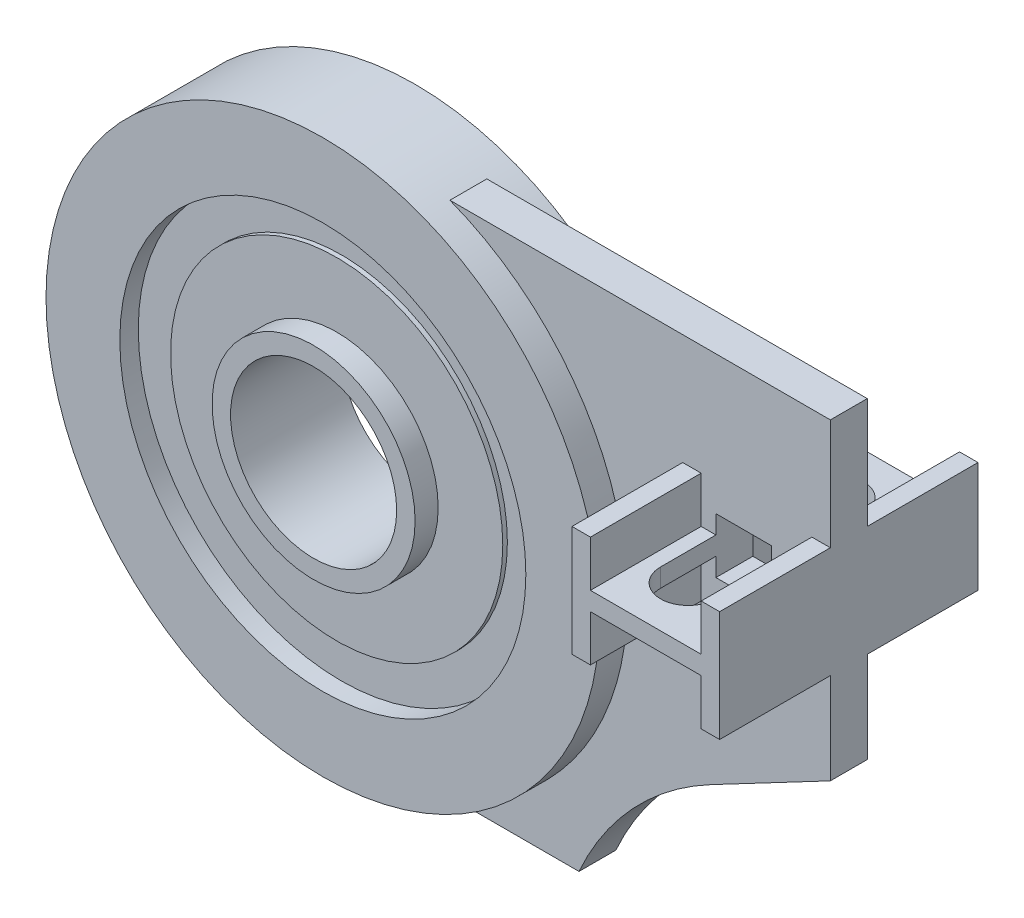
from build123d import *

# Parameters (mm, degrees)
ESQUISSE1_R            = 15
ESQUISSE1_R_2          = 11
EXTERIEUR_PALIER_DEPTH = 2.5
ESQUISSE2_R            = 11
ESQUISSE2_R_2          = 9
SILICONE_DEPTH         = 1.5
ESQUISSE3_R            = 9
ESQUISSE3_R_2          = 5.5
FLASQUE_PALIER_DEPTH   = 1.75
ESQUISSE4_R            = 5.5
ESQUISSE4_R_2          = 4.5
PORT_E_PALIER_DEPTH    = 3
PLAQUE_DEPTH           = 1
EXTRUDE_H_DEPTH        = 6
PASSAGE_START          = -2
PASSAGE_VIS_DEPTH      = 3


with BuildPart() as part:
    # Esquisse1 → Exterieur palier (new, symmetric)
    with BuildSketch(Plane.XY):
        Circle(ESQUISSE1_R)
        Circle(ESQUISSE1_R_2, mode=Mode.SUBTRACT)
    extrude(amount=EXTERIEUR_PALIER_DEPTH, both=True)

    # Esquisse2 → Silicone (add, symmetric)
    with BuildSketch(Plane.XY):
        Circle(ESQUISSE2_R)
        Circle(ESQUISSE2_R_2, mode=Mode.SUBTRACT)
    extrude(amount=SILICONE_DEPTH, both=True)

    # Esquisse3 → Flasque palier (add, symmetric)
    with BuildSketch(Plane.XY):
        Circle(ESQUISSE3_R)
        Circle(ESQUISSE3_R_2, mode=Mode.SUBTRACT)
    extrude(amount=FLASQUE_PALIER_DEPTH, both=True)

    # Esquisse4 → Port_e palier (add, symmetric)
    with BuildSketch(Plane.XY):
        Circle(ESQUISSE4_R)
        Circle(ESQUISSE4_R_2, mode=Mode.SUBTRACT)
    extrude(amount=PORT_E_PALIER_DEPTH, both=True)

    # Esquisse5 → Plaque (add, symmetric)
    with BuildSketch(Plane.XY):
        with BuildLine():
            Line((5.385164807, 14), (26, 14))
            Line((26, 14), (26, -2.940031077))
            Line((26, -2.940031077), (25.767331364, -3.062687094))
            Line((25.767331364, -3.062687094), (21.334229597, -5.399687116))
            Line((21.334229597, -5.399687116), (19.538586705, -6.346296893))
            ThreePointArc((19.538586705, -6.346296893), (16.974504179, -8.03045977), (14.778973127, -10.173020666))
            ThreePointArc((14.778973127, -10.173020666), (13.443665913, -12.001423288), (12.379808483, -14))
            Line((12.379808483, -14), (5.385164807, -14))
            ThreePointArc((5.385164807, -14), (15, 0), (5.385164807, 14))
        make_face()
    extrude(amount=PLAQUE_DEPTH, both=True)

    # Esquisse6 → Extrude H (add)
    with BuildSketch(Plane(origin=(0, 0, -1), x_dir=(-1, 0, 0), z_dir=(0, 0, -1))):
        Polygon((-26, 8), (-25, 8), (-25, 5.5), (-19, 5.5), (-19, 8), (-18, 8), (-18, 2), (-19, 2), (-19, 4.5), (-25, 4.5), (-25, 2), (-26, 2), align=None)
    extrude_h = extrude(amount=EXTRUDE_H_DEPTH)

    # Esquisse7 → Passage vis (cut)
    with BuildSketch(Plane(origin=(0, 5.5, 0), x_dir=(-1, 0, 0), z_dir=(0, 1, 0)).offset(PASSAGE_START)):
        with BuildLine():
            Line((-22.8, 1), (-22.8, -4))
            ThreePointArc((-22.8, -4), (-21.3, -5.5), (-19.8, -4))
            Line((-19.8, -4), (-19.8, 1))
            Line((-19.8, 1), (-22.8, 1))
        make_face()
    passage_vis = extrude(amount=PASSAGE_VIS_DEPTH, mode=Mode.SUBTRACT)

    # Sym_trie1: Extrude H, Passage vis across plane
    add(extrude_h.mirror(Plane.XY))
    add(passage_vis.mirror(Plane.XY), mode=Mode.SUBTRACT)


solid = part.part
